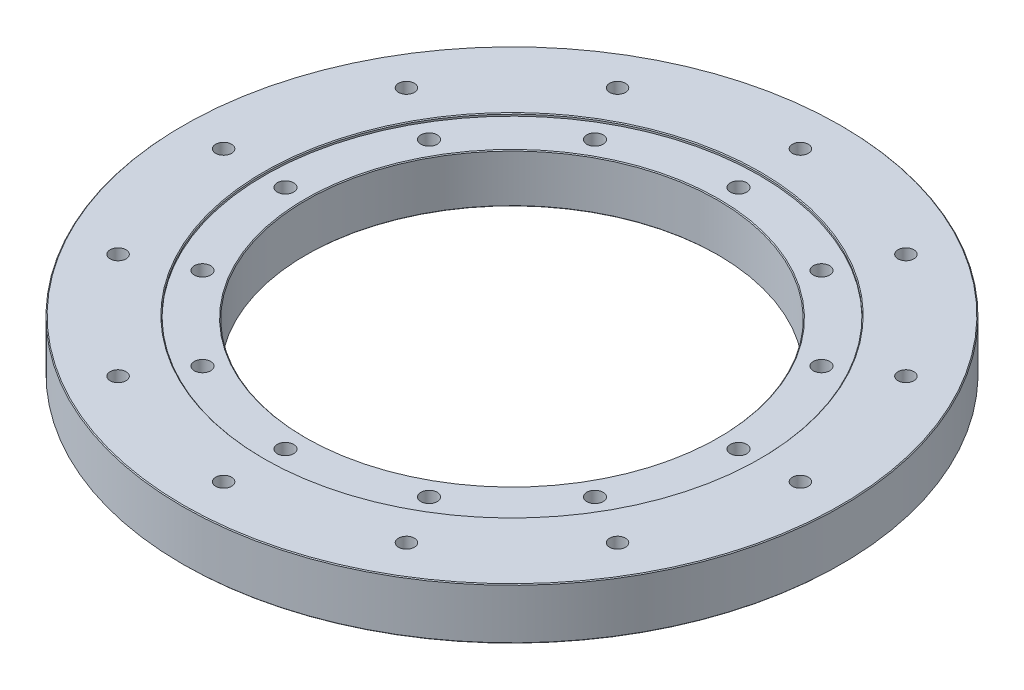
ISO-10303-21;
HEADER;
FILE_DESCRIPTION(('STEP AP214'),'2;1');
FILE_NAME('part.step','',(''),(''),'','','');
FILE_SCHEMA(('AUTOMOTIVE_DESIGN { 1 0 10303 214 1 1 1 1 }'));
ENDSEC;
DATA;
#1=APPLICATION_CONTEXT('core data for automotive mechanical design processes');
#2=APPLICATION_PROTOCOL_DEFINITION('international standard','automotive_design',2000,#1);
#3=PRODUCT_CONTEXT('',#1,'mechanical');
#4=PRODUCT('Part','Part','',(#3));
#5=PRODUCT_RELATED_PRODUCT_CATEGORY('part','',(#4));
#6=PRODUCT_DEFINITION_FORMATION('','',#4);
#7=PRODUCT_DEFINITION_CONTEXT('part definition',#1,'design');
#8=PRODUCT_DEFINITION('design','',#6,#7);
#9=PRODUCT_DEFINITION_SHAPE('','',#8);
#10=(LENGTH_UNIT() NAMED_UNIT(*) SI_UNIT(.MILLI.,.METRE.));
#11=(NAMED_UNIT(*) PLANE_ANGLE_UNIT() SI_UNIT($,.RADIAN.));
#12=(NAMED_UNIT(*) SI_UNIT($,.STERADIAN.) SOLID_ANGLE_UNIT());
#13=UNCERTAINTY_MEASURE_WITH_UNIT(LENGTH_MEASURE(1.E-05),#10,'distance_accuracy_value','');
#14=(GEOMETRIC_REPRESENTATION_CONTEXT(3) GLOBAL_UNCERTAINTY_ASSIGNED_CONTEXT((#13)) GLOBAL_UNIT_ASSIGNED_CONTEXT((#10,
#11,#12)) REPRESENTATION_CONTEXT('',''));
#15=CARTESIAN_POINT('',(0.,0.,0.));
#16=DIRECTION('',(0.,0.,1.));
#17=DIRECTION('',(1.,0.,0.));
#18=AXIS2_PLACEMENT_3D('',#15,#16,#17);
#19=CARTESIAN_POINT('',(0.,0.,0.));
#20=DIRECTION('',(0.,1.,0.));
#21=DIRECTION('',(0.,0.,1.));
#22=AXIS2_PLACEMENT_3D('',#19,#20,#21);
#23=PLANE('',#22);
#24=CARTESIAN_POINT('',(0.,0.,0.));
#25=DIRECTION('',(0.,1.,0.));
#26=DIRECTION('',(0.,0.,1.));
#27=AXIS2_PLACEMENT_3D('',#24,#25,#26);
#28=CIRCLE('',#27,127.508);
#29=CARTESIAN_POINT('',(0.,0.,127.508));
#30=VERTEX_POINT('',#29);
#31=EDGE_CURVE('E55',#30,#30,#28,.T.);
#32=ORIENTED_EDGE('',*,*,#31,.T.);
#33=EDGE_LOOP('',(#32));
#34=FACE_BOUND('',#33,.T.);
#35=CARTESIAN_POINT('',(0.,0.,0.));
#36=DIRECTION('',(0.,1.,0.));
#37=DIRECTION('',(0.,0.,1.));
#38=AXIS2_PLACEMENT_3D('',#35,#36,#37);
#39=CIRCLE('',#38,202.692);
#40=CARTESIAN_POINT('',(0.,0.,202.692));
#41=VERTEX_POINT('',#40);
#42=EDGE_CURVE('E70',#41,#41,#39,.F.);
#43=ORIENTED_EDGE('',*,*,#42,.T.);
#44=EDGE_LOOP('',(#43));
#45=FACE_BOUND('',#44,.T.);
#46=CARTESIAN_POINT('',(0.,0.,-177.8));
#47=DIRECTION('',(0.,1.,0.));
#48=DIRECTION('',(0.,0.,1.));
#49=AXIS2_PLACEMENT_3D('',#46,#47,#48);
#50=CIRCLE('',#49,4.90219999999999);
#51=CARTESIAN_POINT('',(0.,0.,-172.8978));
#52=VERTEX_POINT('',#51);
#53=EDGE_CURVE('E295',#52,#52,#50,.T.);
#54=ORIENTED_EDGE('',*,*,#53,.T.);
#55=EDGE_LOOP('',(#54));
#56=FACE_BOUND('',#55,.T.);
#57=CARTESIAN_POINT('',(88.9,0.,-153.979316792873));
#58=DIRECTION('',(0.,1.,0.));
#59=DIRECTION('',(0.,0.,1.));
#60=AXIS2_PLACEMENT_3D('',#57,#58,#59);
#61=CIRCLE('',#60,4.9022);
#62=CARTESIAN_POINT('',(88.9,0.,-149.077116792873));
#63=VERTEX_POINT('',#62);
#64=EDGE_CURVE('E289',#63,#63,#61,.T.);
#65=ORIENTED_EDGE('',*,*,#64,.T.);
#66=EDGE_LOOP('',(#65));
#67=FACE_BOUND('',#66,.T.);
#68=CARTESIAN_POINT('',(153.979316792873,0.,-88.9));
#69=DIRECTION('',(0.,1.,0.));
#70=DIRECTION('',(0.,0.,1.));
#71=AXIS2_PLACEMENT_3D('',#68,#69,#70);
#72=CIRCLE('',#71,4.9022);
#73=CARTESIAN_POINT('',(153.979316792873,0.,-83.9978));
#74=VERTEX_POINT('',#73);
#75=EDGE_CURVE('E283',#74,#74,#72,.T.);
#76=ORIENTED_EDGE('',*,*,#75,.T.);
#77=EDGE_LOOP('',(#76));
#78=FACE_BOUND('',#77,.T.);
#79=CARTESIAN_POINT('',(177.8,0.,0.));
#80=DIRECTION('',(0.,1.,0.));
#81=DIRECTION('',(0.,0.,1.));
#82=AXIS2_PLACEMENT_3D('',#79,#80,#81);
#83=CIRCLE('',#82,4.9022);
#84=CARTESIAN_POINT('',(177.8,0.,4.90219999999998));
#85=VERTEX_POINT('',#84);
#86=EDGE_CURVE('E277',#85,#85,#83,.T.);
#87=ORIENTED_EDGE('',*,*,#86,.T.);
#88=EDGE_LOOP('',(#87));
#89=FACE_BOUND('',#88,.T.);
#90=CARTESIAN_POINT('',(153.979316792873,0.,88.9));
#91=DIRECTION('',(0.,1.,0.));
#92=DIRECTION('',(0.,0.,1.));
#93=AXIS2_PLACEMENT_3D('',#90,#91,#92);
#94=CIRCLE('',#93,4.9022);
#95=CARTESIAN_POINT('',(153.979316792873,0.,93.8022));
#96=VERTEX_POINT('',#95);
#97=EDGE_CURVE('E271',#96,#96,#94,.T.);
#98=ORIENTED_EDGE('',*,*,#97,.T.);
#99=EDGE_LOOP('',(#98));
#100=FACE_BOUND('',#99,.T.);
#101=CARTESIAN_POINT('',(88.9,-1.11022302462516E-13,153.979316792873));
#102=DIRECTION('',(0.,1.,0.));
#103=DIRECTION('',(0.,0.,1.));
#104=AXIS2_PLACEMENT_3D('',#101,#102,#103);
#105=CIRCLE('',#104,4.9022);
#106=CARTESIAN_POINT('',(88.9,-1.12054943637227E-13,158.881516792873));
#107=VERTEX_POINT('',#106);
#108=EDGE_CURVE('E265',#107,#107,#105,.T.);
#109=ORIENTED_EDGE('',*,*,#108,.T.);
#110=EDGE_LOOP('',(#109));
#111=FACE_BOUND('',#110,.T.);
#112=CARTESIAN_POINT('',(0.,-1.11022302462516E-13,177.8));
#113=DIRECTION('',(0.,1.,0.));
#114=DIRECTION('',(0.,0.,1.));
#115=AXIS2_PLACEMENT_3D('',#112,#113,#114);
#116=CIRCLE('',#115,4.90219999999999);
#117=CARTESIAN_POINT('',(0.,-1.12054943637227E-13,182.7022));
#118=VERTEX_POINT('',#117);
#119=EDGE_CURVE('E259',#118,#118,#116,.T.);
#120=ORIENTED_EDGE('',*,*,#119,.T.);
#121=EDGE_LOOP('',(#120));
#122=FACE_BOUND('',#121,.T.);
#123=CARTESIAN_POINT('',(-88.8999999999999,-1.11022302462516E-13,153.979316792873));
#124=DIRECTION('',(0.,1.,0.));
#125=DIRECTION('',(0.,0.,1.));
#126=AXIS2_PLACEMENT_3D('',#123,#124,#125);
#127=CIRCLE('',#126,4.9022);
#128=CARTESIAN_POINT('',(-88.8999999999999,-1.12054943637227E-13,158.881516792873));
#129=VERTEX_POINT('',#128);
#130=EDGE_CURVE('E253',#129,#129,#127,.T.);
#131=ORIENTED_EDGE('',*,*,#130,.T.);
#132=EDGE_LOOP('',(#131));
#133=FACE_BOUND('',#132,.T.);
#134=CARTESIAN_POINT('',(-153.979316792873,0.,88.9000000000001));
#135=DIRECTION('',(0.,1.,0.));
#136=DIRECTION('',(0.,0.,1.));
#137=AXIS2_PLACEMENT_3D('',#134,#135,#136);
#138=CIRCLE('',#137,4.9022);
#139=CARTESIAN_POINT('',(-153.979316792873,0.,93.8022000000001));
#140=VERTEX_POINT('',#139);
#141=EDGE_CURVE('E247',#140,#140,#138,.T.);
#142=ORIENTED_EDGE('',*,*,#141,.T.);
#143=EDGE_LOOP('',(#142));
#144=FACE_BOUND('',#143,.T.);
#145=CARTESIAN_POINT('',(-177.8,0.,0.));
#146=DIRECTION('',(0.,1.,0.));
#147=DIRECTION('',(0.,0.,1.));
#148=AXIS2_PLACEMENT_3D('',#145,#146,#147);
#149=CIRCLE('',#148,4.9022);
#150=CARTESIAN_POINT('',(-177.8,0.,4.90220000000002));
#151=VERTEX_POINT('',#150);
#152=EDGE_CURVE('E241',#151,#151,#149,.T.);
#153=ORIENTED_EDGE('',*,*,#152,.T.);
#154=EDGE_LOOP('',(#153));
#155=FACE_BOUND('',#154,.T.);
#156=CARTESIAN_POINT('',(-153.979316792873,0.,-88.8999999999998));
#157=DIRECTION('',(0.,1.,0.));
#158=DIRECTION('',(0.,0.,1.));
#159=AXIS2_PLACEMENT_3D('',#156,#157,#158);
#160=CIRCLE('',#159,4.9022);
#161=CARTESIAN_POINT('',(-153.979316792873,0.,-83.9977999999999));
#162=VERTEX_POINT('',#161);
#163=EDGE_CURVE('E235',#162,#162,#160,.T.);
#164=ORIENTED_EDGE('',*,*,#163,.T.);
#165=EDGE_LOOP('',(#164));
#166=FACE_BOUND('',#165,.T.);
#167=CARTESIAN_POINT('',(-88.9,0.,-153.979316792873));
#168=DIRECTION('',(0.,1.,0.));
#169=DIRECTION('',(0.,0.,1.));
#170=AXIS2_PLACEMENT_3D('',#167,#168,#169);
#171=CIRCLE('',#170,4.9022);
#172=CARTESIAN_POINT('',(-88.9,0.,-149.077116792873));
#173=VERTEX_POINT('',#172);
#174=EDGE_CURVE('E229',#173,#173,#171,.T.);
#175=ORIENTED_EDGE('',*,*,#174,.T.);
#176=EDGE_LOOP('',(#175));
#177=FACE_BOUND('',#176,.T.);
#178=CARTESIAN_POINT('',(0.,0.,139.7));
#179=DIRECTION('',(0.,-1.,0.));
#180=DIRECTION('',(0.,0.,-1.));
#181=AXIS2_PLACEMENT_3D('',#178,#179,#180);
#182=CIRCLE('',#181,11.1125);
#183=CARTESIAN_POINT('',(0.,0.,128.5875));
#184=VERTEX_POINT('',#183);
#185=EDGE_CURVE('E226',#184,#184,#182,.T.);
#186=ORIENTED_EDGE('',*,*,#185,.F.);
#187=EDGE_LOOP('',(#186));
#188=FACE_BOUND('',#187,.T.);
#189=CARTESIAN_POINT('',(69.85,0.,120.983748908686));
#190=DIRECTION('',(0.,-1.,0.));
#191=DIRECTION('',(0.,0.,-1.));
#192=AXIS2_PLACEMENT_3D('',#189,#190,#191);
#193=CIRCLE('',#192,11.1125);
#194=CARTESIAN_POINT('',(69.85,0.,109.871248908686));
#195=VERTEX_POINT('',#194);
#196=EDGE_CURVE('E214',#195,#195,#193,.T.);
#197=ORIENTED_EDGE('',*,*,#196,.F.);
#198=EDGE_LOOP('',(#197));
#199=FACE_BOUND('',#198,.T.);
#200=CARTESIAN_POINT('',(120.983748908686,0.,69.85));
#201=DIRECTION('',(0.,-1.,0.));
#202=DIRECTION('',(0.,0.,-1.));
#203=AXIS2_PLACEMENT_3D('',#200,#201,#202);
#204=CIRCLE('',#203,11.1125);
#205=CARTESIAN_POINT('',(120.983748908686,0.,58.7375));
#206=VERTEX_POINT('',#205);
#207=EDGE_CURVE('E202',#206,#206,#204,.T.);
#208=ORIENTED_EDGE('',*,*,#207,.F.);
#209=EDGE_LOOP('',(#208));
#210=FACE_BOUND('',#209,.T.);
#211=CARTESIAN_POINT('',(139.7,0.,0.));
#212=DIRECTION('',(0.,-1.,0.));
#213=DIRECTION('',(0.,0.,-1.));
#214=AXIS2_PLACEMENT_3D('',#211,#212,#213);
#215=CIRCLE('',#214,11.1125);
#216=CARTESIAN_POINT('',(139.7,0.,-11.1125));
#217=VERTEX_POINT('',#216);
#218=EDGE_CURVE('E190',#217,#217,#215,.T.);
#219=ORIENTED_EDGE('',*,*,#218,.F.);
#220=EDGE_LOOP('',(#219));
#221=FACE_BOUND('',#220,.T.);
#222=CARTESIAN_POINT('',(120.983748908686,0.,-69.85));
#223=DIRECTION('',(0.,-1.,0.));
#224=DIRECTION('',(0.,0.,-1.));
#225=AXIS2_PLACEMENT_3D('',#222,#223,#224);
#226=CIRCLE('',#225,11.1125);
#227=CARTESIAN_POINT('',(120.983748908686,0.,-80.9625));
#228=VERTEX_POINT('',#227);
#229=EDGE_CURVE('E178',#228,#228,#226,.T.);
#230=ORIENTED_EDGE('',*,*,#229,.F.);
#231=EDGE_LOOP('',(#230));
#232=FACE_BOUND('',#231,.T.);
#233=CARTESIAN_POINT('',(69.8500000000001,0.,-120.983748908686));
#234=DIRECTION('',(0.,-1.,0.));
#235=DIRECTION('',(0.,0.,-1.));
#236=AXIS2_PLACEMENT_3D('',#233,#234,#235);
#237=CIRCLE('',#236,11.1125);
#238=CARTESIAN_POINT('',(69.8500000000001,0.,-132.096248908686));
#239=VERTEX_POINT('',#238);
#240=EDGE_CURVE('E166',#239,#239,#237,.T.);
#241=ORIENTED_EDGE('',*,*,#240,.F.);
#242=EDGE_LOOP('',(#241));
#243=FACE_BOUND('',#242,.T.);
#244=CARTESIAN_POINT('',(0.,0.,-139.7));
#245=DIRECTION('',(0.,-1.,0.));
#246=DIRECTION('',(0.,0.,-1.));
#247=AXIS2_PLACEMENT_3D('',#244,#245,#246);
#248=CIRCLE('',#247,11.1125);
#249=CARTESIAN_POINT('',(0.,0.,-150.8125));
#250=VERTEX_POINT('',#249);
#251=EDGE_CURVE('E154',#250,#250,#248,.T.);
#252=ORIENTED_EDGE('',*,*,#251,.F.);
#253=EDGE_LOOP('',(#252));
#254=FACE_BOUND('',#253,.T.);
#255=CARTESIAN_POINT('',(-69.85,0.,-120.983748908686));
#256=DIRECTION('',(0.,-1.,0.));
#257=DIRECTION('',(0.,0.,-1.));
#258=AXIS2_PLACEMENT_3D('',#255,#256,#257);
#259=CIRCLE('',#258,11.1125);
#260=CARTESIAN_POINT('',(-69.85,0.,-132.096248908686));
#261=VERTEX_POINT('',#260);
#262=EDGE_CURVE('E142',#261,#261,#259,.T.);
#263=ORIENTED_EDGE('',*,*,#262,.F.);
#264=EDGE_LOOP('',(#263));
#265=FACE_BOUND('',#264,.T.);
#266=CARTESIAN_POINT('',(-120.983748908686,0.,-69.8500000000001));
#267=DIRECTION('',(0.,-1.,0.));
#268=DIRECTION('',(0.,0.,-1.));
#269=AXIS2_PLACEMENT_3D('',#266,#267,#268);
#270=CIRCLE('',#269,11.1125);
#271=CARTESIAN_POINT('',(-120.983748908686,0.,-80.9625000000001));
#272=VERTEX_POINT('',#271);
#273=EDGE_CURVE('E130',#272,#272,#270,.T.);
#274=ORIENTED_EDGE('',*,*,#273,.F.);
#275=EDGE_LOOP('',(#274));
#276=FACE_BOUND('',#275,.T.);
#277=CARTESIAN_POINT('',(-120.983748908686,0.,69.8499999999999));
#278=DIRECTION('',(0.,-1.,0.));
#279=DIRECTION('',(0.,0.,-1.));
#280=AXIS2_PLACEMENT_3D('',#277,#278,#279);
#281=CIRCLE('',#280,11.1125);
#282=CARTESIAN_POINT('',(-120.983748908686,0.,58.7374999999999));
#283=VERTEX_POINT('',#282);
#284=EDGE_CURVE('E106',#283,#283,#281,.T.);
#285=ORIENTED_EDGE('',*,*,#284,.F.);
#286=EDGE_LOOP('',(#285));
#287=FACE_BOUND('',#286,.T.);
#288=CARTESIAN_POINT('',(-69.85,0.,120.983748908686));
#289=DIRECTION('',(0.,-1.,0.));
#290=DIRECTION('',(0.,0.,-1.));
#291=AXIS2_PLACEMENT_3D('',#288,#289,#290);
#292=CIRCLE('',#291,11.1125);
#293=CARTESIAN_POINT('',(-69.85,0.,109.871248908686));
#294=VERTEX_POINT('',#293);
#295=EDGE_CURVE('E94',#294,#294,#292,.T.);
#296=ORIENTED_EDGE('',*,*,#295,.F.);
#297=EDGE_LOOP('',(#296));
#298=FACE_BOUND('',#297,.T.);
#299=CARTESIAN_POINT('',(-139.7,0.,0.));
#300=DIRECTION('',(0.,-1.,0.));
#301=DIRECTION('',(0.,0.,-1.));
#302=AXIS2_PLACEMENT_3D('',#299,#300,#301);
#303=CIRCLE('',#302,11.1125);
#304=CARTESIAN_POINT('',(-139.7,0.,-11.1125));
#305=VERTEX_POINT('',#304);
#306=EDGE_CURVE('E118',#305,#305,#303,.T.);
#307=ORIENTED_EDGE('',*,*,#306,.F.);
#308=EDGE_LOOP('',(#307));
#309=FACE_BOUND('',#308,.T.);
#310=ADVANCED_FACE('F44',(#34,#45,#56,#67,#78,#89,#100,#111,#122,#133,#144,#155,#166,#177,#188,
#199,#210,#221,#232,#243,#254,#265,#276,#287,#298,#309),#23,.F.);
#311=CARTESIAN_POINT('',(0.,30.1625,5.14996031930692E-13));
#312=DIRECTION('',(0.,1.,0.));
#313=DIRECTION('',(0.,0.,1.));
#314=AXIS2_PLACEMENT_3D('',#311,#312,#313);
#315=PLANE('',#314);
#316=CARTESIAN_POINT('',(0.,30.1625,0.));
#317=DIRECTION('',(0.,1.,0.));
#318=DIRECTION('',(0.,0.,1.));
#319=AXIS2_PLACEMENT_3D('',#316,#317,#318);
#320=CIRCLE('',#319,127.508);
#321=CARTESIAN_POINT('',(0.,30.1625,127.508));
#322=VERTEX_POINT('',#321);
#323=EDGE_CURVE('E67',#322,#322,#320,.F.);
#324=ORIENTED_EDGE('',*,*,#323,.T.);
#325=EDGE_LOOP('',(#324));
#326=FACE_BOUND('',#325,.T.);
#327=CARTESIAN_POINT('',(0.,30.1625,139.7));
#328=DIRECTION('',(0.,1.,0.));
#329=DIRECTION('',(0.,0.,1.));
#330=AXIS2_PLACEMENT_3D('',#327,#328,#329);
#331=CIRCLE('',#330,5.04189999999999);
#332=CARTESIAN_POINT('',(0.,30.1625,144.7419));
#333=VERTEX_POINT('',#332);
#334=EDGE_CURVE('E217',#333,#333,#331,.T.);
#335=ORIENTED_EDGE('',*,*,#334,.F.);
#336=EDGE_LOOP('',(#335));
#337=FACE_BOUND('',#336,.T.);
#338=CARTESIAN_POINT('',(69.85,30.1625,120.983748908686));
#339=DIRECTION('',(0.,1.,0.));
#340=DIRECTION('',(0.,0.,1.));
#341=AXIS2_PLACEMENT_3D('',#338,#339,#340);
#342=CIRCLE('',#341,5.04189999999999);
#343=CARTESIAN_POINT('',(69.85,30.1625,126.025648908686));
#344=VERTEX_POINT('',#343);
#345=EDGE_CURVE('E205',#344,#344,#342,.T.);
#346=ORIENTED_EDGE('',*,*,#345,.F.);
#347=EDGE_LOOP('',(#346));
#348=FACE_BOUND('',#347,.T.);
#349=CARTESIAN_POINT('',(120.983748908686,30.1625,69.85));
#350=DIRECTION('',(0.,1.,0.));
#351=DIRECTION('',(0.,0.,1.));
#352=AXIS2_PLACEMENT_3D('',#349,#350,#351);
#353=CIRCLE('',#352,5.04189999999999);
#354=CARTESIAN_POINT('',(120.983748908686,30.1625,74.8919));
#355=VERTEX_POINT('',#354);
#356=EDGE_CURVE('E193',#355,#355,#353,.T.);
#357=ORIENTED_EDGE('',*,*,#356,.F.);
#358=EDGE_LOOP('',(#357));
#359=FACE_BOUND('',#358,.T.);
#360=CARTESIAN_POINT('',(139.7,30.1625,0.));
#361=DIRECTION('',(0.,1.,0.));
#362=DIRECTION('',(0.,0.,1.));
#363=AXIS2_PLACEMENT_3D('',#360,#361,#362);
#364=CIRCLE('',#363,5.04189999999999);
#365=CARTESIAN_POINT('',(139.7,30.1625,5.0419));
#366=VERTEX_POINT('',#365);
#367=EDGE_CURVE('E181',#366,#366,#364,.T.);
#368=ORIENTED_EDGE('',*,*,#367,.F.);
#369=EDGE_LOOP('',(#368));
#370=FACE_BOUND('',#369,.T.);
#371=CARTESIAN_POINT('',(120.983748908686,30.1625,-69.85));
#372=DIRECTION('',(0.,1.,0.));
#373=DIRECTION('',(0.,0.,1.));
#374=AXIS2_PLACEMENT_3D('',#371,#372,#373);
#375=CIRCLE('',#374,5.04189999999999);
#376=CARTESIAN_POINT('',(120.983748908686,30.1625,-64.8081));
#377=VERTEX_POINT('',#376);
#378=EDGE_CURVE('E169',#377,#377,#375,.T.);
#379=ORIENTED_EDGE('',*,*,#378,.F.);
#380=EDGE_LOOP('',(#379));
#381=FACE_BOUND('',#380,.T.);
#382=CARTESIAN_POINT('',(69.8500000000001,30.1625,-120.983748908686));
#383=DIRECTION('',(0.,1.,0.));
#384=DIRECTION('',(0.,0.,1.));
#385=AXIS2_PLACEMENT_3D('',#382,#383,#384);
#386=CIRCLE('',#385,5.04189999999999);
#387=CARTESIAN_POINT('',(69.8500000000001,30.1625,-115.941848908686));
#388=VERTEX_POINT('',#387);
#389=EDGE_CURVE('E157',#388,#388,#386,.T.);
#390=ORIENTED_EDGE('',*,*,#389,.F.);
#391=EDGE_LOOP('',(#390));
#392=FACE_BOUND('',#391,.T.);
#393=CARTESIAN_POINT('',(0.,30.1625,-139.7));
#394=DIRECTION('',(0.,1.,0.));
#395=DIRECTION('',(0.,0.,1.));
#396=AXIS2_PLACEMENT_3D('',#393,#394,#395);
#397=CIRCLE('',#396,5.04189999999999);
#398=CARTESIAN_POINT('',(0.,30.1625,-134.6581));
#399=VERTEX_POINT('',#398);
#400=EDGE_CURVE('E145',#399,#399,#397,.T.);
#401=ORIENTED_EDGE('',*,*,#400,.F.);
#402=EDGE_LOOP('',(#401));
#403=FACE_BOUND('',#402,.T.);
#404=CARTESIAN_POINT('',(-69.85,30.1625,-120.983748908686));
#405=DIRECTION('',(0.,1.,0.));
#406=DIRECTION('',(0.,0.,1.));
#407=AXIS2_PLACEMENT_3D('',#404,#405,#406);
#408=CIRCLE('',#407,5.04189999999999);
#409=CARTESIAN_POINT('',(-69.85,30.1625,-115.941848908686));
#410=VERTEX_POINT('',#409);
#411=EDGE_CURVE('E133',#410,#410,#408,.T.);
#412=ORIENTED_EDGE('',*,*,#411,.F.);
#413=EDGE_LOOP('',(#412));
#414=FACE_BOUND('',#413,.T.);
#415=CARTESIAN_POINT('',(-120.983748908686,30.1625,-69.8500000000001));
#416=DIRECTION('',(0.,1.,0.));
#417=DIRECTION('',(0.,0.,1.));
#418=AXIS2_PLACEMENT_3D('',#415,#416,#417);
#419=CIRCLE('',#418,5.04189999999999);
#420=CARTESIAN_POINT('',(-120.983748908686,30.1625,-64.8081000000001));
#421=VERTEX_POINT('',#420);
#422=EDGE_CURVE('E121',#421,#421,#419,.T.);
#423=ORIENTED_EDGE('',*,*,#422,.F.);
#424=EDGE_LOOP('',(#423));
#425=FACE_BOUND('',#424,.T.);
#426=CARTESIAN_POINT('',(-139.7,30.1625,0.));
#427=DIRECTION('',(0.,1.,0.));
#428=DIRECTION('',(0.,0.,1.));
#429=AXIS2_PLACEMENT_3D('',#426,#427,#428);
#430=CIRCLE('',#429,5.04189999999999);
#431=CARTESIAN_POINT('',(-139.7,30.1625,5.04189999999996));
#432=VERTEX_POINT('',#431);
#433=EDGE_CURVE('E109',#432,#432,#430,.T.);
#434=ORIENTED_EDGE('',*,*,#433,.F.);
#435=EDGE_LOOP('',(#434));
#436=FACE_BOUND('',#435,.T.);
#437=CARTESIAN_POINT('',(-120.983748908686,30.1625,69.8499999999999));
#438=DIRECTION('',(0.,1.,0.));
#439=DIRECTION('',(0.,0.,1.));
#440=AXIS2_PLACEMENT_3D('',#437,#438,#439);
#441=CIRCLE('',#440,5.04189999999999);
#442=CARTESIAN_POINT('',(-120.983748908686,30.1625,74.8918999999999));
#443=VERTEX_POINT('',#442);
#444=EDGE_CURVE('E97',#443,#443,#441,.T.);
#445=ORIENTED_EDGE('',*,*,#444,.F.);
#446=EDGE_LOOP('',(#445));
#447=FACE_BOUND('',#446,.T.);
#448=CARTESIAN_POINT('',(-69.85,30.1625,120.983748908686));
#449=DIRECTION('',(0.,1.,0.));
#450=DIRECTION('',(0.,0.,1.));
#451=AXIS2_PLACEMENT_3D('',#448,#449,#450);
#452=CIRCLE('',#451,5.04189999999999);
#453=CARTESIAN_POINT('',(-69.85,30.1625,126.025648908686));
#454=VERTEX_POINT('',#453);
#455=EDGE_CURVE('E85',#454,#454,#452,.T.);
#456=ORIENTED_EDGE('',*,*,#455,.F.);
#457=EDGE_LOOP('',(#456));
#458=FACE_BOUND('',#457,.T.);
#459=CARTESIAN_POINT('',(0.,30.1625,0.));
#460=DIRECTION('',(0.,-1.,0.));
#461=DIRECTION('',(0.,0.,-1.));
#462=AXIS2_PLACEMENT_3D('',#459,#460,#461);
#463=CIRCLE('',#462,152.6032);
#464=CARTESIAN_POINT('',(0.,30.1625,-152.6032));
#465=VERTEX_POINT('',#464);
#466=EDGE_CURVE('E82',#465,#465,#463,.T.);
#467=ORIENTED_EDGE('',*,*,#466,.F.);
#468=EDGE_LOOP('',(#467));
#469=FACE_BOUND('',#468,.T.);
#470=ADVANCED_FACE('F350',(#326,#337,#348,#359,#370,#381,#392,#403,#414,#425,#436,#447,#458,
#469),#315,.T.);
#471=CARTESIAN_POINT('',(0.,0.,0.));
#472=DIRECTION('',(0.,-1.,0.));
#473=DIRECTION('',(0.,0.,-1.));
#474=AXIS2_PLACEMENT_3D('',#471,#472,#473);
#475=CYLINDRICAL_SURFACE('',#474,152.6032);
#476=CARTESIAN_POINT('',(0.,31.2419999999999,0.));
#477=DIRECTION('',(0.,1.,0.));
#478=DIRECTION('',(0.,0.,1.));
#479=AXIS2_PLACEMENT_3D('',#476,#477,#478);
#480=CIRCLE('',#479,152.6032);
#481=CARTESIAN_POINT('',(0.,31.2419999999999,152.6032));
#482=VERTEX_POINT('',#481);
#483=EDGE_CURVE('E12',#482,#482,#480,.T.);
#484=ORIENTED_EDGE('',*,*,#483,.T.);
#485=EDGE_LOOP('',(#484));
#486=FACE_BOUND('',#485,.T.);
#487=ORIENTED_EDGE('',*,*,#466,.T.);
#488=EDGE_LOOP('',(#487));
#489=FACE_BOUND('',#488,.T.);
#490=ADVANCED_FACE('F308',(#486,#489),#475,.F.);
#491=CARTESIAN_POINT('',(0.,31.75,0.));
#492=DIRECTION('',(0.,1.,0.));
#493=DIRECTION('',(0.,0.,1.));
#494=AXIS2_PLACEMENT_3D('',#491,#492,#493);
#495=PLANE('',#494);
#496=CARTESIAN_POINT('',(0.,31.75,0.));
#497=DIRECTION('',(0.,1.,0.));
#498=DIRECTION('',(0.,0.,1.));
#499=AXIS2_PLACEMENT_3D('',#496,#497,#498);
#500=CIRCLE('',#499,153.1112);
#501=CARTESIAN_POINT('',(0.,31.75,153.1112));
#502=VERTEX_POINT('',#501);
#503=EDGE_CURVE('E51',#502,#502,#500,.F.);
#504=ORIENTED_EDGE('',*,*,#503,.T.);
#505=EDGE_LOOP('',(#504));
#506=FACE_BOUND('',#505,.T.);
#507=CARTESIAN_POINT('',(0.,31.75,0.));
#508=DIRECTION('',(0.,1.,0.));
#509=DIRECTION('',(0.,0.,1.));
#510=AXIS2_PLACEMENT_3D('',#507,#508,#509);
#511=CIRCLE('',#510,202.692);
#512=CARTESIAN_POINT('',(0.,31.75,202.692));
#513=VERTEX_POINT('',#512);
#514=EDGE_CURVE('E73',#513,#513,#511,.T.);
#515=ORIENTED_EDGE('',*,*,#514,.T.);
#516=EDGE_LOOP('',(#515));
#517=FACE_BOUND('',#516,.T.);
#518=CARTESIAN_POINT('',(0.,31.75,-177.8));
#519=DIRECTION('',(0.,1.,0.));
#520=DIRECTION('',(0.,0.,1.));
#521=AXIS2_PLACEMENT_3D('',#518,#519,#520);
#522=CIRCLE('',#521,4.90219999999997);
#523=CARTESIAN_POINT('',(0.,31.75,-172.8978));
#524=VERTEX_POINT('',#523);
#525=EDGE_CURVE('E298',#524,#524,#522,.T.);
#526=ORIENTED_EDGE('',*,*,#525,.F.);
#527=EDGE_LOOP('',(#526));
#528=FACE_BOUND('',#527,.T.);
#529=CARTESIAN_POINT('',(88.9,31.75,-153.979316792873));
#530=DIRECTION('',(0.,1.,0.));
#531=DIRECTION('',(0.,0.,1.));
#532=AXIS2_PLACEMENT_3D('',#529,#530,#531);
#533=CIRCLE('',#532,4.90219999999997);
#534=CARTESIAN_POINT('',(88.9,31.75,-149.077116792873));
#535=VERTEX_POINT('',#534);
#536=EDGE_CURVE('E292',#535,#535,#533,.T.);
#537=ORIENTED_EDGE('',*,*,#536,.F.);
#538=EDGE_LOOP('',(#537));
#539=FACE_BOUND('',#538,.T.);
#540=CARTESIAN_POINT('',(153.979316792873,31.75,-88.9));
#541=DIRECTION('',(0.,1.,0.));
#542=DIRECTION('',(0.,0.,1.));
#543=AXIS2_PLACEMENT_3D('',#540,#541,#542);
#544=CIRCLE('',#543,4.90219999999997);
#545=CARTESIAN_POINT('',(153.979316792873,31.75,-83.9978));
#546=VERTEX_POINT('',#545);
#547=EDGE_CURVE('E286',#546,#546,#544,.T.);
#548=ORIENTED_EDGE('',*,*,#547,.F.);
#549=EDGE_LOOP('',(#548));
#550=FACE_BOUND('',#549,.T.);
#551=CARTESIAN_POINT('',(177.8,31.75,0.));
#552=DIRECTION('',(0.,1.,0.));
#553=DIRECTION('',(0.,0.,1.));
#554=AXIS2_PLACEMENT_3D('',#551,#552,#553);
#555=CIRCLE('',#554,4.90219999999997);
#556=CARTESIAN_POINT('',(177.8,31.75,4.90219999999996));
#557=VERTEX_POINT('',#556);
#558=EDGE_CURVE('E280',#557,#557,#555,.T.);
#559=ORIENTED_EDGE('',*,*,#558,.F.);
#560=EDGE_LOOP('',(#559));
#561=FACE_BOUND('',#560,.T.);
#562=CARTESIAN_POINT('',(153.979316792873,31.75,88.9));
#563=DIRECTION('',(0.,1.,0.));
#564=DIRECTION('',(0.,0.,1.));
#565=AXIS2_PLACEMENT_3D('',#562,#563,#564);
#566=CIRCLE('',#565,4.90219999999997);
#567=CARTESIAN_POINT('',(153.979316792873,31.75,93.8021999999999));
#568=VERTEX_POINT('',#567);
#569=EDGE_CURVE('E274',#568,#568,#566,.T.);
#570=ORIENTED_EDGE('',*,*,#569,.F.);
#571=EDGE_LOOP('',(#570));
#572=FACE_BOUND('',#571,.T.);
#573=CARTESIAN_POINT('',(88.9,31.7499999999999,153.979316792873));
#574=DIRECTION('',(0.,1.,0.));
#575=DIRECTION('',(0.,0.,1.));
#576=AXIS2_PLACEMENT_3D('',#573,#574,#575);
#577=CIRCLE('',#576,4.90219999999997);
#578=CARTESIAN_POINT('',(88.9,31.7499999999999,158.881516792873));
#579=VERTEX_POINT('',#578);
#580=EDGE_CURVE('E268',#579,#579,#577,.T.);
#581=ORIENTED_EDGE('',*,*,#580,.F.);
#582=EDGE_LOOP('',(#581));
#583=FACE_BOUND('',#582,.T.);
#584=CARTESIAN_POINT('',(0.,31.7499999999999,177.8));
#585=DIRECTION('',(0.,1.,0.));
#586=DIRECTION('',(0.,0.,1.));
#587=AXIS2_PLACEMENT_3D('',#584,#585,#586);
#588=CIRCLE('',#587,4.90219999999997);
#589=CARTESIAN_POINT('',(0.,31.7499999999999,182.7022));
#590=VERTEX_POINT('',#589);
#591=EDGE_CURVE('E262',#590,#590,#588,.T.);
#592=ORIENTED_EDGE('',*,*,#591,.F.);
#593=EDGE_LOOP('',(#592));
#594=FACE_BOUND('',#593,.T.);
#595=CARTESIAN_POINT('',(-88.8999999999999,31.7499999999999,153.979316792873));
#596=DIRECTION('',(0.,1.,0.));
#597=DIRECTION('',(0.,0.,1.));
#598=AXIS2_PLACEMENT_3D('',#595,#596,#597);
#599=CIRCLE('',#598,4.90219999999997);
#600=CARTESIAN_POINT('',(-88.8999999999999,31.7499999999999,158.881516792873));
#601=VERTEX_POINT('',#600);
#602=EDGE_CURVE('E256',#601,#601,#599,.T.);
#603=ORIENTED_EDGE('',*,*,#602,.F.);
#604=EDGE_LOOP('',(#603));
#605=FACE_BOUND('',#604,.T.);
#606=CARTESIAN_POINT('',(-153.979316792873,31.75,88.9000000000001));
#607=DIRECTION('',(0.,1.,0.));
#608=DIRECTION('',(0.,0.,1.));
#609=AXIS2_PLACEMENT_3D('',#606,#607,#608);
#610=CIRCLE('',#609,4.90219999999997);
#611=CARTESIAN_POINT('',(-153.979316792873,31.75,93.8022));
#612=VERTEX_POINT('',#611);
#613=EDGE_CURVE('E250',#612,#612,#610,.T.);
#614=ORIENTED_EDGE('',*,*,#613,.F.);
#615=EDGE_LOOP('',(#614));
#616=FACE_BOUND('',#615,.T.);
#617=CARTESIAN_POINT('',(-177.8,31.75,0.));
#618=DIRECTION('',(0.,1.,0.));
#619=DIRECTION('',(0.,0.,1.));
#620=AXIS2_PLACEMENT_3D('',#617,#618,#619);
#621=CIRCLE('',#620,4.90219999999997);
#622=CARTESIAN_POINT('',(-177.8,31.75,4.9022));
#623=VERTEX_POINT('',#622);
#624=EDGE_CURVE('E244',#623,#623,#621,.T.);
#625=ORIENTED_EDGE('',*,*,#624,.F.);
#626=EDGE_LOOP('',(#625));
#627=FACE_BOUND('',#626,.T.);
#628=CARTESIAN_POINT('',(-153.979316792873,31.75,-88.8999999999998));
#629=DIRECTION('',(0.,1.,0.));
#630=DIRECTION('',(0.,0.,1.));
#631=AXIS2_PLACEMENT_3D('',#628,#629,#630);
#632=CIRCLE('',#631,4.90219999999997);
#633=CARTESIAN_POINT('',(-153.979316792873,31.75,-83.9977999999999));
#634=VERTEX_POINT('',#633);
#635=EDGE_CURVE('E238',#634,#634,#632,.T.);
#636=ORIENTED_EDGE('',*,*,#635,.F.);
#637=EDGE_LOOP('',(#636));
#638=FACE_BOUND('',#637,.T.);
#639=CARTESIAN_POINT('',(-88.9,31.75,-153.979316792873));
#640=DIRECTION('',(0.,1.,0.));
#641=DIRECTION('',(0.,0.,1.));
#642=AXIS2_PLACEMENT_3D('',#639,#640,#641);
#643=CIRCLE('',#642,4.90219999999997);
#644=CARTESIAN_POINT('',(-88.9,31.75,-149.077116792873));
#645=VERTEX_POINT('',#644);
#646=EDGE_CURVE('E232',#645,#645,#643,.T.);
#647=ORIENTED_EDGE('',*,*,#646,.F.);
#648=EDGE_LOOP('',(#647));
#649=FACE_BOUND('',#648,.T.);
#650=ADVANCED_FACE('F304',(#506,#517,#528,#539,#550,#561,#572,#583,#594,#605,#616,#627,#638,
#649),#495,.T.);
#651=CARTESIAN_POINT('',(0.,0.,0.));
#652=DIRECTION('',(0.,-1.,0.));
#653=DIRECTION('',(0.,0.,-1.));
#654=AXIS2_PLACEMENT_3D('',#651,#652,#653);
#655=CYLINDRICAL_SURFACE('',#654,203.2);
#656=CARTESIAN_POINT('',(0.,31.242,0.));
#657=DIRECTION('',(0.,1.,0.));
#658=DIRECTION('',(0.,0.,1.));
#659=AXIS2_PLACEMENT_3D('',#656,#657,#658);
#660=CIRCLE('',#659,203.2);
#661=CARTESIAN_POINT('',(0.,31.242,203.2));
#662=VERTEX_POINT('',#661);
#663=EDGE_CURVE('E76',#662,#662,#660,.F.);
#664=ORIENTED_EDGE('',*,*,#663,.T.);
#665=EDGE_LOOP('',(#664));
#666=FACE_BOUND('',#665,.T.);
#667=CARTESIAN_POINT('',(0.,0.507999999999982,0.));
#668=DIRECTION('',(0.,1.,0.));
#669=DIRECTION('',(0.,0.,1.));
#670=AXIS2_PLACEMENT_3D('',#667,#668,#669);
#671=CIRCLE('',#670,203.2);
#672=CARTESIAN_POINT('',(0.,0.507999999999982,203.2));
#673=VERTEX_POINT('',#672);
#674=EDGE_CURVE('E79',#673,#673,#671,.T.);
#675=ORIENTED_EDGE('',*,*,#674,.T.);
#676=EDGE_LOOP('',(#675));
#677=FACE_BOUND('',#676,.T.);
#678=ADVANCED_FACE('F307',(#666,#677),#655,.T.);
#679=CARTESIAN_POINT('',(0.,0.,0.));
#680=DIRECTION('',(0.,-1.,0.));
#681=DIRECTION('',(0.,0.,-1.));
#682=AXIS2_PLACEMENT_3D('',#679,#680,#681);
#683=CYLINDRICAL_SURFACE('',#682,127.);
#684=CARTESIAN_POINT('',(0.,29.6545,0.));
#685=DIRECTION('',(0.,1.,0.));
#686=DIRECTION('',(0.,0.,1.));
#687=AXIS2_PLACEMENT_3D('',#684,#685,#686);
#688=CIRCLE('',#687,127.);
#689=CARTESIAN_POINT('',(0.,29.6545,127.));
#690=VERTEX_POINT('',#689);
#691=EDGE_CURVE('E59',#690,#690,#688,.T.);
#692=ORIENTED_EDGE('',*,*,#691,.T.);
#693=EDGE_LOOP('',(#692));
#694=FACE_BOUND('',#693,.T.);
#695=CARTESIAN_POINT('',(0.,0.507999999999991,0.));
#696=DIRECTION('',(0.,1.,0.));
#697=DIRECTION('',(0.,0.,1.));
#698=AXIS2_PLACEMENT_3D('',#695,#696,#697);
#699=CIRCLE('',#698,127.);
#700=CARTESIAN_POINT('',(0.,0.507999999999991,127.));
#701=VERTEX_POINT('',#700);
#702=EDGE_CURVE('E64',#701,#701,#699,.F.);
#703=ORIENTED_EDGE('',*,*,#702,.T.);
#704=EDGE_LOOP('',(#703));
#705=FACE_BOUND('',#704,.T.);
#706=ADVANCED_FACE('F361',(#694,#705),#683,.F.);
#707=CARTESIAN_POINT('',(-69.85,0.,120.983748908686));
#708=DIRECTION('',(0.,-1.,0.));
#709=DIRECTION('',(0.,0.,-1.));
#710=AXIS2_PLACEMENT_3D('',#707,#708,#709);
#711=CYLINDRICAL_SURFACE('',#710,5.04189999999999);
#712=CARTESIAN_POINT('',(-69.85,13.8684,120.983748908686));
#713=DIRECTION('',(0.,-1.,0.));
#714=DIRECTION('',(0.,0.,-1.));
#715=AXIS2_PLACEMENT_3D('',#712,#713,#714);
#716=CIRCLE('',#715,5.0419);
#717=CARTESIAN_POINT('',(-69.85,13.8684,115.941848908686));
#718=VERTEX_POINT('',#717);
#719=EDGE_CURVE('E88',#718,#718,#716,.T.);
#720=ORIENTED_EDGE('',*,*,#719,.T.);
#721=EDGE_LOOP('',(#720));
#722=FACE_BOUND('',#721,.T.);
#723=ORIENTED_EDGE('',*,*,#455,.T.);
#724=EDGE_LOOP('',(#723));
#725=FACE_BOUND('',#724,.T.);
#726=ADVANCED_FACE('F391',(#722,#725),#711,.F.);
#727=CARTESIAN_POINT('',(-64.8081,13.8684,120.983748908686));
#728=DIRECTION('',(0.,1.,0.));
#729=DIRECTION('',(0.,0.,1.));
#730=AXIS2_PLACEMENT_3D('',#727,#728,#729);
#731=PLANE('',#730);
#732=ORIENTED_EDGE('',*,*,#719,.F.);
#733=EDGE_LOOP('',(#732));
#734=FACE_BOUND('',#733,.T.);
#735=CARTESIAN_POINT('',(-69.85,13.8684,120.983748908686));
#736=DIRECTION('',(0.,-1.,0.));
#737=DIRECTION('',(0.,0.,-1.));
#738=AXIS2_PLACEMENT_3D('',#735,#736,#737);
#739=CIRCLE('',#738,11.1125);
#740=CARTESIAN_POINT('',(-69.85,13.8684,109.871248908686));
#741=VERTEX_POINT('',#740);
#742=EDGE_CURVE('E91',#741,#741,#739,.T.);
#743=ORIENTED_EDGE('',*,*,#742,.T.);
#744=EDGE_LOOP('',(#743));
#745=FACE_BOUND('',#744,.T.);
#746=ADVANCED_FACE('F396',(#734,#745),#731,.F.);
#747=CARTESIAN_POINT('',(-69.85,0.,120.983748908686));
#748=DIRECTION('',(0.,-1.,0.));
#749=DIRECTION('',(0.,0.,-1.));
#750=AXIS2_PLACEMENT_3D('',#747,#748,#749);
#751=CYLINDRICAL_SURFACE('',#750,11.1125);
#752=ORIENTED_EDGE('',*,*,#742,.F.);
#753=EDGE_LOOP('',(#752));
#754=FACE_BOUND('',#753,.T.);
#755=ORIENTED_EDGE('',*,*,#295,.T.);
#756=EDGE_LOOP('',(#755));
#757=FACE_BOUND('',#756,.T.);
#758=ADVANCED_FACE('F433',(#754,#757),#751,.F.);
#759=CARTESIAN_POINT('',(-120.983748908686,0.,69.8499999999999));
#760=DIRECTION('',(0.,-1.,0.));
#761=DIRECTION('',(0.,0.,-1.));
#762=AXIS2_PLACEMENT_3D('',#759,#760,#761);
#763=CYLINDRICAL_SURFACE('',#762,5.04189999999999);
#764=CARTESIAN_POINT('',(-120.983748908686,13.8684,69.8499999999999));
#765=DIRECTION('',(0.,-1.,0.));
#766=DIRECTION('',(0.,0.,-1.));
#767=AXIS2_PLACEMENT_3D('',#764,#765,#766);
#768=CIRCLE('',#767,5.0419);
#769=CARTESIAN_POINT('',(-120.983748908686,13.8684,64.8080999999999));
#770=VERTEX_POINT('',#769);
#771=EDGE_CURVE('E100',#770,#770,#768,.T.);
#772=ORIENTED_EDGE('',*,*,#771,.T.);
#773=EDGE_LOOP('',(#772));
#774=FACE_BOUND('',#773,.T.);
#775=ORIENTED_EDGE('',*,*,#444,.T.);
#776=EDGE_LOOP('',(#775));
#777=FACE_BOUND('',#776,.T.);
#778=ADVANCED_FACE('F430',(#774,#777),#763,.F.);
#779=CARTESIAN_POINT('',(-115.941848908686,13.8684,69.8499999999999));
#780=DIRECTION('',(0.,1.,0.));
#781=DIRECTION('',(0.,0.,1.));
#782=AXIS2_PLACEMENT_3D('',#779,#780,#781);
#783=PLANE('',#782);
#784=ORIENTED_EDGE('',*,*,#771,.F.);
#785=EDGE_LOOP('',(#784));
#786=FACE_BOUND('',#785,.T.);
#787=CARTESIAN_POINT('',(-120.983748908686,13.8684,69.8499999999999));
#788=DIRECTION('',(0.,-1.,0.));
#789=DIRECTION('',(0.,0.,-1.));
#790=AXIS2_PLACEMENT_3D('',#787,#788,#789);
#791=CIRCLE('',#790,11.1125);
#792=CARTESIAN_POINT('',(-120.983748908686,13.8684,58.7374999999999));
#793=VERTEX_POINT('',#792);
#794=EDGE_CURVE('E103',#793,#793,#791,.T.);
#795=ORIENTED_EDGE('',*,*,#794,.T.);
#796=EDGE_LOOP('',(#795));
#797=FACE_BOUND('',#796,.T.);
#798=ADVANCED_FACE('F432',(#786,#797),#783,.F.);
#799=CARTESIAN_POINT('',(-120.983748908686,0.,69.8499999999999));
#800=DIRECTION('',(0.,-1.,0.));
#801=DIRECTION('',(0.,0.,-1.));
#802=AXIS2_PLACEMENT_3D('',#799,#800,#801);
#803=CYLINDRICAL_SURFACE('',#802,11.1125);
#804=ORIENTED_EDGE('',*,*,#794,.F.);
#805=EDGE_LOOP('',(#804));
#806=FACE_BOUND('',#805,.T.);
#807=ORIENTED_EDGE('',*,*,#284,.T.);
#808=EDGE_LOOP('',(#807));
#809=FACE_BOUND('',#808,.T.);
#810=ADVANCED_FACE('F440',(#806,#809),#803,.F.);
#811=CARTESIAN_POINT('',(-139.7,0.,0.));
#812=DIRECTION('',(0.,-1.,0.));
#813=DIRECTION('',(0.,0.,-1.));
#814=AXIS2_PLACEMENT_3D('',#811,#812,#813);
#815=CYLINDRICAL_SURFACE('',#814,5.04189999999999);
#816=CARTESIAN_POINT('',(-139.7,13.8684,0.));
#817=DIRECTION('',(0.,-1.,0.));
#818=DIRECTION('',(0.,0.,-1.));
#819=AXIS2_PLACEMENT_3D('',#816,#817,#818);
#820=CIRCLE('',#819,5.04189999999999);
#821=CARTESIAN_POINT('',(-139.7,13.8684,-5.04190000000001));
#822=VERTEX_POINT('',#821);
#823=EDGE_CURVE('E112',#822,#822,#820,.T.);
#824=ORIENTED_EDGE('',*,*,#823,.T.);
#825=EDGE_LOOP('',(#824));
#826=FACE_BOUND('',#825,.T.);
#827=ORIENTED_EDGE('',*,*,#433,.T.);
#828=EDGE_LOOP('',(#827));
#829=FACE_BOUND('',#828,.T.);
#830=ADVANCED_FACE('F473',(#826,#829),#815,.F.);
#831=CARTESIAN_POINT('',(-134.6581,13.8684,0.));
#832=DIRECTION('',(0.,1.,0.));
#833=DIRECTION('',(0.,0.,1.));
#834=AXIS2_PLACEMENT_3D('',#831,#832,#833);
#835=PLANE('',#834);
#836=ORIENTED_EDGE('',*,*,#823,.F.);
#837=EDGE_LOOP('',(#836));
#838=FACE_BOUND('',#837,.T.);
#839=CARTESIAN_POINT('',(-139.7,13.8684,0.));
#840=DIRECTION('',(0.,-1.,0.));
#841=DIRECTION('',(0.,0.,-1.));
#842=AXIS2_PLACEMENT_3D('',#839,#840,#841);
#843=CIRCLE('',#842,11.1125);
#844=CARTESIAN_POINT('',(-139.7,13.8684,-11.1125));
#845=VERTEX_POINT('',#844);
#846=EDGE_CURVE('E115',#845,#845,#843,.T.);
#847=ORIENTED_EDGE('',*,*,#846,.T.);
#848=EDGE_LOOP('',(#847));
#849=FACE_BOUND('',#848,.T.);
#850=ADVANCED_FACE('F463',(#838,#849),#835,.F.);
#851=CARTESIAN_POINT('',(-139.7,0.,0.));
#852=DIRECTION('',(0.,-1.,0.));
#853=DIRECTION('',(0.,0.,-1.));
#854=AXIS2_PLACEMENT_3D('',#851,#852,#853);
#855=CYLINDRICAL_SURFACE('',#854,11.1125);
#856=ORIENTED_EDGE('',*,*,#846,.F.);
#857=EDGE_LOOP('',(#856));
#858=FACE_BOUND('',#857,.T.);
#859=ORIENTED_EDGE('',*,*,#306,.T.);
#860=EDGE_LOOP('',(#859));
#861=FACE_BOUND('',#860,.T.);
#862=ADVANCED_FACE('F460',(#858,#861),#855,.F.);
#863=CARTESIAN_POINT('',(-120.983748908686,0.,-69.8500000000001));
#864=DIRECTION('',(0.,-1.,0.));
#865=DIRECTION('',(0.,0.,-1.));
#866=AXIS2_PLACEMENT_3D('',#863,#864,#865);
#867=CYLINDRICAL_SURFACE('',#866,5.04189999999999);
#868=CARTESIAN_POINT('',(-120.983748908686,13.8684,-69.8500000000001));
#869=DIRECTION('',(0.,-1.,0.));
#870=DIRECTION('',(0.,0.,-1.));
#871=AXIS2_PLACEMENT_3D('',#868,#869,#870);
#872=CIRCLE('',#871,5.0419);
#873=CARTESIAN_POINT('',(-120.983748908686,13.8684,-74.8919000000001));
#874=VERTEX_POINT('',#873);
#875=EDGE_CURVE('E124',#874,#874,#872,.T.);
#876=ORIENTED_EDGE('',*,*,#875,.T.);
#877=EDGE_LOOP('',(#876));
#878=FACE_BOUND('',#877,.T.);
#879=ORIENTED_EDGE('',*,*,#422,.T.);
#880=EDGE_LOOP('',(#879));
#881=FACE_BOUND('',#880,.T.);
#882=ADVANCED_FACE('F462',(#878,#881),#867,.F.);
#883=CARTESIAN_POINT('',(-115.941848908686,13.8684,-69.8500000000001));
#884=DIRECTION('',(0.,1.,0.));
#885=DIRECTION('',(0.,0.,1.));
#886=AXIS2_PLACEMENT_3D('',#883,#884,#885);
#887=PLANE('',#886);
#888=ORIENTED_EDGE('',*,*,#875,.F.);
#889=EDGE_LOOP('',(#888));
#890=FACE_BOUND('',#889,.T.);
#891=CARTESIAN_POINT('',(-120.983748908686,13.8684,-69.8500000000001));
#892=DIRECTION('',(0.,-1.,0.));
#893=DIRECTION('',(0.,0.,-1.));
#894=AXIS2_PLACEMENT_3D('',#891,#892,#893);
#895=CIRCLE('',#894,11.1125);
#896=CARTESIAN_POINT('',(-120.983748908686,13.8684,-80.9625000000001));
#897=VERTEX_POINT('',#896);
#898=EDGE_CURVE('E127',#897,#897,#895,.T.);
#899=ORIENTED_EDGE('',*,*,#898,.T.);
#900=EDGE_LOOP('',(#899));
#901=FACE_BOUND('',#900,.T.);
#902=ADVANCED_FACE('F470',(#890,#901),#887,.F.);
#903=CARTESIAN_POINT('',(-120.983748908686,0.,-69.8500000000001));
#904=DIRECTION('',(0.,-1.,0.));
#905=DIRECTION('',(0.,0.,-1.));
#906=AXIS2_PLACEMENT_3D('',#903,#904,#905);
#907=CYLINDRICAL_SURFACE('',#906,11.1125);
#908=ORIENTED_EDGE('',*,*,#898,.F.);
#909=EDGE_LOOP('',(#908));
#910=FACE_BOUND('',#909,.T.);
#911=ORIENTED_EDGE('',*,*,#273,.T.);
#912=EDGE_LOOP('',(#911));
#913=FACE_BOUND('',#912,.T.);
#914=ADVANCED_FACE('F519',(#910,#913),#907,.F.);
#915=CARTESIAN_POINT('',(-69.85,0.,-120.983748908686));
#916=DIRECTION('',(0.,-1.,0.));
#917=DIRECTION('',(0.,0.,-1.));
#918=AXIS2_PLACEMENT_3D('',#915,#916,#917);
#919=CYLINDRICAL_SURFACE('',#918,5.04189999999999);
#920=CARTESIAN_POINT('',(-69.85,13.8684,-120.983748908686));
#921=DIRECTION('',(0.,-1.,0.));
#922=DIRECTION('',(0.,0.,-1.));
#923=AXIS2_PLACEMENT_3D('',#920,#921,#922);
#924=CIRCLE('',#923,5.0419);
#925=CARTESIAN_POINT('',(-69.85,13.8684,-126.025648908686));
#926=VERTEX_POINT('',#925);
#927=EDGE_CURVE('E136',#926,#926,#924,.T.);
#928=ORIENTED_EDGE('',*,*,#927,.T.);
#929=EDGE_LOOP('',(#928));
#930=FACE_BOUND('',#929,.T.);
#931=ORIENTED_EDGE('',*,*,#411,.T.);
#932=EDGE_LOOP('',(#931));
#933=FACE_BOUND('',#932,.T.);
#934=ADVANCED_FACE('F528',(#930,#933),#919,.F.);
#935=CARTESIAN_POINT('',(-64.8081,13.8684,-120.983748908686));
#936=DIRECTION('',(0.,1.,0.));
#937=DIRECTION('',(0.,0.,1.));
#938=AXIS2_PLACEMENT_3D('',#935,#936,#937);
#939=PLANE('',#938);
#940=ORIENTED_EDGE('',*,*,#927,.F.);
#941=EDGE_LOOP('',(#940));
#942=FACE_BOUND('',#941,.T.);
#943=CARTESIAN_POINT('',(-69.85,13.8684,-120.983748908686));
#944=DIRECTION('',(0.,-1.,0.));
#945=DIRECTION('',(0.,0.,-1.));
#946=AXIS2_PLACEMENT_3D('',#943,#944,#945);
#947=CIRCLE('',#946,11.1125);
#948=CARTESIAN_POINT('',(-69.85,13.8684,-132.096248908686));
#949=VERTEX_POINT('',#948);
#950=EDGE_CURVE('E139',#949,#949,#947,.T.);
#951=ORIENTED_EDGE('',*,*,#950,.T.);
#952=EDGE_LOOP('',(#951));
#953=FACE_BOUND('',#952,.T.);
#954=ADVANCED_FACE('F538',(#942,#953),#939,.F.);
#955=CARTESIAN_POINT('',(-69.85,0.,-120.983748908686));
#956=DIRECTION('',(0.,-1.,0.));
#957=DIRECTION('',(0.,0.,-1.));
#958=AXIS2_PLACEMENT_3D('',#955,#956,#957);
#959=CYLINDRICAL_SURFACE('',#958,11.1125);
#960=ORIENTED_EDGE('',*,*,#950,.F.);
#961=EDGE_LOOP('',(#960));
#962=FACE_BOUND('',#961,.T.);
#963=ORIENTED_EDGE('',*,*,#262,.T.);
#964=EDGE_LOOP('',(#963));
#965=FACE_BOUND('',#964,.T.);
#966=ADVANCED_FACE('F548',(#962,#965),#959,.F.);
#967=CARTESIAN_POINT('',(0.,0.,-139.7));
#968=DIRECTION('',(0.,-1.,0.));
#969=DIRECTION('',(0.,0.,-1.));
#970=AXIS2_PLACEMENT_3D('',#967,#968,#969);
#971=CYLINDRICAL_SURFACE('',#970,5.04189999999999);
#972=CARTESIAN_POINT('',(0.,13.8684,-139.7));
#973=DIRECTION('',(0.,-1.,0.));
#974=DIRECTION('',(0.,0.,-1.));
#975=AXIS2_PLACEMENT_3D('',#972,#973,#974);
#976=CIRCLE('',#975,5.0419);
#977=CARTESIAN_POINT('',(0.,13.8684,-144.7419));
#978=VERTEX_POINT('',#977);
#979=EDGE_CURVE('E148',#978,#978,#976,.T.);
#980=ORIENTED_EDGE('',*,*,#979,.T.);
#981=EDGE_LOOP('',(#980));
#982=FACE_BOUND('',#981,.T.);
#983=ORIENTED_EDGE('',*,*,#400,.T.);
#984=EDGE_LOOP('',(#983));
#985=FACE_BOUND('',#984,.T.);
#986=ADVANCED_FACE('F558',(#982,#985),#971,.F.);
#987=CARTESIAN_POINT('',(5.04190000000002,13.8684,-139.7));
#988=DIRECTION('',(0.,1.,0.));
#989=DIRECTION('',(0.,0.,1.));
#990=AXIS2_PLACEMENT_3D('',#987,#988,#989);
#991=PLANE('',#990);
#992=ORIENTED_EDGE('',*,*,#979,.F.);
#993=EDGE_LOOP('',(#992));
#994=FACE_BOUND('',#993,.T.);
#995=CARTESIAN_POINT('',(0.,13.8684,-139.7));
#996=DIRECTION('',(0.,-1.,0.));
#997=DIRECTION('',(0.,0.,-1.));
#998=AXIS2_PLACEMENT_3D('',#995,#996,#997);
#999=CIRCLE('',#998,11.1125);
#1000=CARTESIAN_POINT('',(0.,13.8684,-150.8125));
#1001=VERTEX_POINT('',#1000);
#1002=EDGE_CURVE('E151',#1001,#1001,#999,.T.);
#1003=ORIENTED_EDGE('',*,*,#1002,.T.);
#1004=EDGE_LOOP('',(#1003));
#1005=FACE_BOUND('',#1004,.T.);
#1006=ADVANCED_FACE('F568',(#994,#1005),#991,.F.);
#1007=CARTESIAN_POINT('',(0.,0.,-139.7));
#1008=DIRECTION('',(0.,-1.,0.));
#1009=DIRECTION('',(0.,0.,-1.));
#1010=AXIS2_PLACEMENT_3D('',#1007,#1008,#1009);
#1011=CYLINDRICAL_SURFACE('',#1010,11.1125);
#1012=ORIENTED_EDGE('',*,*,#1002,.F.);
#1013=EDGE_LOOP('',(#1012));
#1014=FACE_BOUND('',#1013,.T.);
#1015=ORIENTED_EDGE('',*,*,#251,.T.);
#1016=EDGE_LOOP('',(#1015));
#1017=FACE_BOUND('',#1016,.T.);
#1018=ADVANCED_FACE('F578',(#1014,#1017),#1011,.F.);
#1019=CARTESIAN_POINT('',(69.8500000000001,0.,-120.983748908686));
#1020=DIRECTION('',(0.,-1.,0.));
#1021=DIRECTION('',(0.,0.,-1.));
#1022=AXIS2_PLACEMENT_3D('',#1019,#1020,#1021);
#1023=CYLINDRICAL_SURFACE('',#1022,5.04189999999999);
#1024=CARTESIAN_POINT('',(69.8500000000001,13.8684,-120.983748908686));
#1025=DIRECTION('',(0.,-1.,0.));
#1026=DIRECTION('',(0.,0.,-1.));
#1027=AXIS2_PLACEMENT_3D('',#1024,#1025,#1026);
#1028=CIRCLE('',#1027,5.0419);
#1029=CARTESIAN_POINT('',(69.8500000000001,13.8684,-126.025648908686));
#1030=VERTEX_POINT('',#1029);
#1031=EDGE_CURVE('E160',#1030,#1030,#1028,.T.);
#1032=ORIENTED_EDGE('',*,*,#1031,.T.);
#1033=EDGE_LOOP('',(#1032));
#1034=FACE_BOUND('',#1033,.T.);
#1035=ORIENTED_EDGE('',*,*,#389,.T.);
#1036=EDGE_LOOP('',(#1035));
#1037=FACE_BOUND('',#1036,.T.);
#1038=ADVANCED_FACE('F588',(#1034,#1037),#1023,.F.);
#1039=CARTESIAN_POINT('',(74.8919,13.8684,-120.983748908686));
#1040=DIRECTION('',(0.,1.,0.));
#1041=DIRECTION('',(0.,0.,1.));
#1042=AXIS2_PLACEMENT_3D('',#1039,#1040,#1041);
#1043=PLANE('',#1042);
#1044=ORIENTED_EDGE('',*,*,#1031,.F.);
#1045=EDGE_LOOP('',(#1044));
#1046=FACE_BOUND('',#1045,.T.);
#1047=CARTESIAN_POINT('',(69.8500000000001,13.8684,-120.983748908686));
#1048=DIRECTION('',(0.,-1.,0.));
#1049=DIRECTION('',(0.,0.,-1.));
#1050=AXIS2_PLACEMENT_3D('',#1047,#1048,#1049);
#1051=CIRCLE('',#1050,11.1125);
#1052=CARTESIAN_POINT('',(69.8500000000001,13.8684,-132.096248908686));
#1053=VERTEX_POINT('',#1052);
#1054=EDGE_CURVE('E163',#1053,#1053,#1051,.T.);
#1055=ORIENTED_EDGE('',*,*,#1054,.T.);
#1056=EDGE_LOOP('',(#1055));
#1057=FACE_BOUND('',#1056,.T.);
#1058=ADVANCED_FACE('F598',(#1046,#1057),#1043,.F.);
#1059=CARTESIAN_POINT('',(69.8500000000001,0.,-120.983748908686));
#1060=DIRECTION('',(0.,-1.,0.));
#1061=DIRECTION('',(0.,0.,-1.));
#1062=AXIS2_PLACEMENT_3D('',#1059,#1060,#1061);
#1063=CYLINDRICAL_SURFACE('',#1062,11.1125);
#1064=ORIENTED_EDGE('',*,*,#1054,.F.);
#1065=EDGE_LOOP('',(#1064));
#1066=FACE_BOUND('',#1065,.T.);
#1067=ORIENTED_EDGE('',*,*,#240,.T.);
#1068=EDGE_LOOP('',(#1067));
#1069=FACE_BOUND('',#1068,.T.);
#1070=ADVANCED_FACE('F608',(#1066,#1069),#1063,.F.);
#1071=CARTESIAN_POINT('',(120.983748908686,0.,-69.85));
#1072=DIRECTION('',(0.,-1.,0.));
#1073=DIRECTION('',(0.,0.,-1.));
#1074=AXIS2_PLACEMENT_3D('',#1071,#1072,#1073);
#1075=CYLINDRICAL_SURFACE('',#1074,5.04189999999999);
#1076=CARTESIAN_POINT('',(120.983748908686,13.8684,-69.85));
#1077=DIRECTION('',(0.,-1.,0.));
#1078=DIRECTION('',(0.,0.,-1.));
#1079=AXIS2_PLACEMENT_3D('',#1076,#1077,#1078);
#1080=CIRCLE('',#1079,5.04189999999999);
#1081=CARTESIAN_POINT('',(120.983748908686,13.8684,-74.8918999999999));
#1082=VERTEX_POINT('',#1081);
#1083=EDGE_CURVE('E172',#1082,#1082,#1080,.T.);
#1084=ORIENTED_EDGE('',*,*,#1083,.T.);
#1085=EDGE_LOOP('',(#1084));
#1086=FACE_BOUND('',#1085,.T.);
#1087=ORIENTED_EDGE('',*,*,#378,.T.);
#1088=EDGE_LOOP('',(#1087));
#1089=FACE_BOUND('',#1088,.T.);
#1090=ADVANCED_FACE('F618',(#1086,#1089),#1075,.F.);
#1091=CARTESIAN_POINT('',(126.025648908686,13.8684,-69.85));
#1092=DIRECTION('',(0.,1.,0.));
#1093=DIRECTION('',(0.,0.,1.));
#1094=AXIS2_PLACEMENT_3D('',#1091,#1092,#1093);
#1095=PLANE('',#1094);
#1096=ORIENTED_EDGE('',*,*,#1083,.F.);
#1097=EDGE_LOOP('',(#1096));
#1098=FACE_BOUND('',#1097,.T.);
#1099=CARTESIAN_POINT('',(120.983748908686,13.8684,-69.85));
#1100=DIRECTION('',(0.,-1.,0.));
#1101=DIRECTION('',(0.,0.,-1.));
#1102=AXIS2_PLACEMENT_3D('',#1099,#1100,#1101);
#1103=CIRCLE('',#1102,11.1125);
#1104=CARTESIAN_POINT('',(120.983748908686,13.8684,-80.9625));
#1105=VERTEX_POINT('',#1104);
#1106=EDGE_CURVE('E175',#1105,#1105,#1103,.T.);
#1107=ORIENTED_EDGE('',*,*,#1106,.T.);
#1108=EDGE_LOOP('',(#1107));
#1109=FACE_BOUND('',#1108,.T.);
#1110=ADVANCED_FACE('F628',(#1098,#1109),#1095,.F.);
#1111=CARTESIAN_POINT('',(120.983748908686,0.,-69.85));
#1112=DIRECTION('',(0.,-1.,0.));
#1113=DIRECTION('',(0.,0.,-1.));
#1114=AXIS2_PLACEMENT_3D('',#1111,#1112,#1113);
#1115=CYLINDRICAL_SURFACE('',#1114,11.1125);
#1116=ORIENTED_EDGE('',*,*,#1106,.F.);
#1117=EDGE_LOOP('',(#1116));
#1118=FACE_BOUND('',#1117,.T.);
#1119=ORIENTED_EDGE('',*,*,#229,.T.);
#1120=EDGE_LOOP('',(#1119));
#1121=FACE_BOUND('',#1120,.T.);
#1122=ADVANCED_FACE('F638',(#1118,#1121),#1115,.F.);
#1123=CARTESIAN_POINT('',(139.7,0.,0.));
#1124=DIRECTION('',(0.,-1.,0.));
#1125=DIRECTION('',(0.,0.,-1.));
#1126=AXIS2_PLACEMENT_3D('',#1123,#1124,#1125);
#1127=CYLINDRICAL_SURFACE('',#1126,5.04189999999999);
#1128=CARTESIAN_POINT('',(139.7,13.8684,0.));
#1129=DIRECTION('',(0.,-1.,0.));
#1130=DIRECTION('',(0.,0.,-1.));
#1131=AXIS2_PLACEMENT_3D('',#1128,#1129,#1130);
#1132=CIRCLE('',#1131,5.04189999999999);
#1133=CARTESIAN_POINT('',(139.7,13.8684,-5.04189999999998));
#1134=VERTEX_POINT('',#1133);
#1135=EDGE_CURVE('E184',#1134,#1134,#1132,.T.);
#1136=ORIENTED_EDGE('',*,*,#1135,.T.);
#1137=EDGE_LOOP('',(#1136));
#1138=FACE_BOUND('',#1137,.T.);
#1139=ORIENTED_EDGE('',*,*,#367,.T.);
#1140=EDGE_LOOP('',(#1139));
#1141=FACE_BOUND('',#1140,.T.);
#1142=ADVANCED_FACE('F648',(#1138,#1141),#1127,.F.);
#1143=CARTESIAN_POINT('',(144.7419,13.8684,0.));
#1144=DIRECTION('',(0.,1.,0.));
#1145=DIRECTION('',(0.,0.,1.));
#1146=AXIS2_PLACEMENT_3D('',#1143,#1144,#1145);
#1147=PLANE('',#1146);
#1148=ORIENTED_EDGE('',*,*,#1135,.F.);
#1149=EDGE_LOOP('',(#1148));
#1150=FACE_BOUND('',#1149,.T.);
#1151=CARTESIAN_POINT('',(139.7,13.8684,0.));
#1152=DIRECTION('',(0.,-1.,0.));
#1153=DIRECTION('',(0.,0.,-1.));
#1154=AXIS2_PLACEMENT_3D('',#1151,#1152,#1153);
#1155=CIRCLE('',#1154,11.1125);
#1156=CARTESIAN_POINT('',(139.7,13.8684,-11.1125));
#1157=VERTEX_POINT('',#1156);
#1158=EDGE_CURVE('E187',#1157,#1157,#1155,.T.);
#1159=ORIENTED_EDGE('',*,*,#1158,.T.);
#1160=EDGE_LOOP('',(#1159));
#1161=FACE_BOUND('',#1160,.T.);
#1162=ADVANCED_FACE('F658',(#1150,#1161),#1147,.F.);
#1163=CARTESIAN_POINT('',(139.7,0.,0.));
#1164=DIRECTION('',(0.,-1.,0.));
#1165=DIRECTION('',(0.,0.,-1.));
#1166=AXIS2_PLACEMENT_3D('',#1163,#1164,#1165);
#1167=CYLINDRICAL_SURFACE('',#1166,11.1125);
#1168=ORIENTED_EDGE('',*,*,#1158,.F.);
#1169=EDGE_LOOP('',(#1168));
#1170=FACE_BOUND('',#1169,.T.);
#1171=ORIENTED_EDGE('',*,*,#218,.T.);
#1172=EDGE_LOOP('',(#1171));
#1173=FACE_BOUND('',#1172,.T.);
#1174=ADVANCED_FACE('F668',(#1170,#1173),#1167,.F.);
#1175=CARTESIAN_POINT('',(120.983748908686,0.,69.85));
#1176=DIRECTION('',(0.,-1.,0.));
#1177=DIRECTION('',(0.,0.,-1.));
#1178=AXIS2_PLACEMENT_3D('',#1175,#1176,#1177);
#1179=CYLINDRICAL_SURFACE('',#1178,5.04189999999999);
#1180=CARTESIAN_POINT('',(120.983748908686,13.8684,69.85));
#1181=DIRECTION('',(0.,-1.,0.));
#1182=DIRECTION('',(0.,0.,-1.));
#1183=AXIS2_PLACEMENT_3D('',#1180,#1181,#1182);
#1184=CIRCLE('',#1183,5.04189999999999);
#1185=CARTESIAN_POINT('',(120.983748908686,13.8684,64.8081));
#1186=VERTEX_POINT('',#1185);
#1187=EDGE_CURVE('E196',#1186,#1186,#1184,.T.);
#1188=ORIENTED_EDGE('',*,*,#1187,.T.);
#1189=EDGE_LOOP('',(#1188));
#1190=FACE_BOUND('',#1189,.T.);
#1191=ORIENTED_EDGE('',*,*,#356,.T.);
#1192=EDGE_LOOP('',(#1191));
#1193=FACE_BOUND('',#1192,.T.);
#1194=ADVANCED_FACE('F678',(#1190,#1193),#1179,.F.);
#1195=CARTESIAN_POINT('',(126.025648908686,13.8684,69.85));
#1196=DIRECTION('',(0.,1.,0.));
#1197=DIRECTION('',(0.,0.,1.));
#1198=AXIS2_PLACEMENT_3D('',#1195,#1196,#1197);
#1199=PLANE('',#1198);
#1200=ORIENTED_EDGE('',*,*,#1187,.F.);
#1201=EDGE_LOOP('',(#1200));
#1202=FACE_BOUND('',#1201,.T.);
#1203=CARTESIAN_POINT('',(120.983748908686,13.8684,69.85));
#1204=DIRECTION('',(0.,-1.,0.));
#1205=DIRECTION('',(0.,0.,-1.));
#1206=AXIS2_PLACEMENT_3D('',#1203,#1204,#1205);
#1207=CIRCLE('',#1206,11.1125);
#1208=CARTESIAN_POINT('',(120.983748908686,13.8684,58.7375));
#1209=VERTEX_POINT('',#1208);
#1210=EDGE_CURVE('E199',#1209,#1209,#1207,.T.);
#1211=ORIENTED_EDGE('',*,*,#1210,.T.);
#1212=EDGE_LOOP('',(#1211));
#1213=FACE_BOUND('',#1212,.T.);
#1214=ADVANCED_FACE('F688',(#1202,#1213),#1199,.F.);
#1215=CARTESIAN_POINT('',(120.983748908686,0.,69.85));
#1216=DIRECTION('',(0.,-1.,0.));
#1217=DIRECTION('',(0.,0.,-1.));
#1218=AXIS2_PLACEMENT_3D('',#1215,#1216,#1217);
#1219=CYLINDRICAL_SURFACE('',#1218,11.1125);
#1220=ORIENTED_EDGE('',*,*,#1210,.F.);
#1221=EDGE_LOOP('',(#1220));
#1222=FACE_BOUND('',#1221,.T.);
#1223=ORIENTED_EDGE('',*,*,#207,.T.);
#1224=EDGE_LOOP('',(#1223));
#1225=FACE_BOUND('',#1224,.T.);
#1226=ADVANCED_FACE('F698',(#1222,#1225),#1219,.F.);
#1227=CARTESIAN_POINT('',(69.85,0.,120.983748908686));
#1228=DIRECTION('',(0.,-1.,0.));
#1229=DIRECTION('',(0.,0.,-1.));
#1230=AXIS2_PLACEMENT_3D('',#1227,#1228,#1229);
#1231=CYLINDRICAL_SURFACE('',#1230,5.04189999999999);
#1232=CARTESIAN_POINT('',(69.85,13.8684,120.983748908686));
#1233=DIRECTION('',(0.,-1.,0.));
#1234=DIRECTION('',(0.,0.,-1.));
#1235=AXIS2_PLACEMENT_3D('',#1232,#1233,#1234);
#1236=CIRCLE('',#1235,5.0419);
#1237=CARTESIAN_POINT('',(69.85,13.8684,115.941848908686));
#1238=VERTEX_POINT('',#1237);
#1239=EDGE_CURVE('E208',#1238,#1238,#1236,.T.);
#1240=ORIENTED_EDGE('',*,*,#1239,.T.);
#1241=EDGE_LOOP('',(#1240));
#1242=FACE_BOUND('',#1241,.T.);
#1243=ORIENTED_EDGE('',*,*,#345,.T.);
#1244=EDGE_LOOP('',(#1243));
#1245=FACE_BOUND('',#1244,.T.);
#1246=ADVANCED_FACE('F708',(#1242,#1245),#1231,.F.);
#1247=CARTESIAN_POINT('',(74.8919,13.8684,120.983748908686));
#1248=DIRECTION('',(0.,1.,0.));
#1249=DIRECTION('',(0.,0.,1.));
#1250=AXIS2_PLACEMENT_3D('',#1247,#1248,#1249);
#1251=PLANE('',#1250);
#1252=ORIENTED_EDGE('',*,*,#1239,.F.);
#1253=EDGE_LOOP('',(#1252));
#1254=FACE_BOUND('',#1253,.T.);
#1255=CARTESIAN_POINT('',(69.85,13.8684,120.983748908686));
#1256=DIRECTION('',(0.,-1.,0.));
#1257=DIRECTION('',(0.,0.,-1.));
#1258=AXIS2_PLACEMENT_3D('',#1255,#1256,#1257);
#1259=CIRCLE('',#1258,11.1125);
#1260=CARTESIAN_POINT('',(69.85,13.8684,109.871248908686));
#1261=VERTEX_POINT('',#1260);
#1262=EDGE_CURVE('E211',#1261,#1261,#1259,.T.);
#1263=ORIENTED_EDGE('',*,*,#1262,.T.);
#1264=EDGE_LOOP('',(#1263));
#1265=FACE_BOUND('',#1264,.T.);
#1266=ADVANCED_FACE('F718',(#1254,#1265),#1251,.F.);
#1267=CARTESIAN_POINT('',(69.85,0.,120.983748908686));
#1268=DIRECTION('',(0.,-1.,0.));
#1269=DIRECTION('',(0.,0.,-1.));
#1270=AXIS2_PLACEMENT_3D('',#1267,#1268,#1269);
#1271=CYLINDRICAL_SURFACE('',#1270,11.1125);
#1272=ORIENTED_EDGE('',*,*,#1262,.F.);
#1273=EDGE_LOOP('',(#1272));
#1274=FACE_BOUND('',#1273,.T.);
#1275=ORIENTED_EDGE('',*,*,#196,.T.);
#1276=EDGE_LOOP('',(#1275));
#1277=FACE_BOUND('',#1276,.T.);
#1278=ADVANCED_FACE('F728',(#1274,#1277),#1271,.F.);
#1279=CARTESIAN_POINT('',(0.,0.,139.7));
#1280=DIRECTION('',(0.,-1.,0.));
#1281=DIRECTION('',(0.,0.,-1.));
#1282=AXIS2_PLACEMENT_3D('',#1279,#1280,#1281);
#1283=CYLINDRICAL_SURFACE('',#1282,5.04189999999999);
#1284=CARTESIAN_POINT('',(0.,13.8684,139.7));
#1285=DIRECTION('',(0.,-1.,0.));
#1286=DIRECTION('',(0.,0.,-1.));
#1287=AXIS2_PLACEMENT_3D('',#1284,#1285,#1286);
#1288=CIRCLE('',#1287,5.0419);
#1289=CARTESIAN_POINT('',(0.,13.8684,134.6581));
#1290=VERTEX_POINT('',#1289);
#1291=EDGE_CURVE('E220',#1290,#1290,#1288,.T.);
#1292=ORIENTED_EDGE('',*,*,#1291,.T.);
#1293=EDGE_LOOP('',(#1292));
#1294=FACE_BOUND('',#1293,.T.);
#1295=ORIENTED_EDGE('',*,*,#334,.T.);
#1296=EDGE_LOOP('',(#1295));
#1297=FACE_BOUND('',#1296,.T.);
#1298=ADVANCED_FACE('F738',(#1294,#1297),#1283,.F.);
#1299=CARTESIAN_POINT('',(5.0419,13.8684,139.7));
#1300=DIRECTION('',(0.,1.,0.));
#1301=DIRECTION('',(0.,0.,1.));
#1302=AXIS2_PLACEMENT_3D('',#1299,#1300,#1301);
#1303=PLANE('',#1302);
#1304=ORIENTED_EDGE('',*,*,#1291,.F.);
#1305=EDGE_LOOP('',(#1304));
#1306=FACE_BOUND('',#1305,.T.);
#1307=CARTESIAN_POINT('',(0.,13.8684,139.7));
#1308=DIRECTION('',(0.,-1.,0.));
#1309=DIRECTION('',(0.,0.,-1.));
#1310=AXIS2_PLACEMENT_3D('',#1307,#1308,#1309);
#1311=CIRCLE('',#1310,11.1125);
#1312=CARTESIAN_POINT('',(0.,13.8684,128.5875));
#1313=VERTEX_POINT('',#1312);
#1314=EDGE_CURVE('E223',#1313,#1313,#1311,.T.);
#1315=ORIENTED_EDGE('',*,*,#1314,.T.);
#1316=EDGE_LOOP('',(#1315));
#1317=FACE_BOUND('',#1316,.T.);
#1318=ADVANCED_FACE('F345',(#1306,#1317),#1303,.F.);
#1319=CARTESIAN_POINT('',(0.,0.,139.7));
#1320=DIRECTION('',(0.,-1.,0.));
#1321=DIRECTION('',(0.,0.,-1.));
#1322=AXIS2_PLACEMENT_3D('',#1319,#1320,#1321);
#1323=CYLINDRICAL_SURFACE('',#1322,11.1125);
#1324=ORIENTED_EDGE('',*,*,#1314,.F.);
#1325=EDGE_LOOP('',(#1324));
#1326=FACE_BOUND('',#1325,.T.);
#1327=ORIENTED_EDGE('',*,*,#185,.T.);
#1328=EDGE_LOOP('',(#1327));
#1329=FACE_BOUND('',#1328,.T.);
#1330=ADVANCED_FACE('F335',(#1326,#1329),#1323,.F.);
#1331=CARTESIAN_POINT('',(-88.9,31.75,-153.979316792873));
#1332=DIRECTION('',(0.,1.,0.));
#1333=DIRECTION('',(0.,0.,1.));
#1334=AXIS2_PLACEMENT_3D('',#1331,#1332,#1333);
#1335=CYLINDRICAL_SURFACE('',#1334,4.90219999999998);
#1336=ORIENTED_EDGE('',*,*,#174,.F.);
#1337=EDGE_LOOP('',(#1336));
#1338=FACE_BOUND('',#1337,.T.);
#1339=ORIENTED_EDGE('',*,*,#646,.T.);
#1340=EDGE_LOOP('',(#1339));
#1341=FACE_BOUND('',#1340,.T.);
#1342=ADVANCED_FACE('F332',(#1338,#1341),#1335,.F.);
#1343=CARTESIAN_POINT('',(-153.979316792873,31.75,-88.8999999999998));
#1344=DIRECTION('',(0.,1.,0.));
#1345=DIRECTION('',(0.,0.,1.));
#1346=AXIS2_PLACEMENT_3D('',#1343,#1344,#1345);
#1347=CYLINDRICAL_SURFACE('',#1346,4.90219999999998);
#1348=ORIENTED_EDGE('',*,*,#163,.F.);
#1349=EDGE_LOOP('',(#1348));
#1350=FACE_BOUND('',#1349,.T.);
#1351=ORIENTED_EDGE('',*,*,#635,.T.);
#1352=EDGE_LOOP('',(#1351));
#1353=FACE_BOUND('',#1352,.T.);
#1354=ADVANCED_FACE('F334',(#1350,#1353),#1347,.F.);
#1355=CARTESIAN_POINT('',(-177.8,31.75,0.));
#1356=DIRECTION('',(0.,1.,0.));
#1357=DIRECTION('',(0.,0.,1.));
#1358=AXIS2_PLACEMENT_3D('',#1355,#1356,#1357);
#1359=CYLINDRICAL_SURFACE('',#1358,4.90219999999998);
#1360=ORIENTED_EDGE('',*,*,#152,.F.);
#1361=EDGE_LOOP('',(#1360));
#1362=FACE_BOUND('',#1361,.T.);
#1363=ORIENTED_EDGE('',*,*,#624,.T.);
#1364=EDGE_LOOP('',(#1363));
#1365=FACE_BOUND('',#1364,.T.);
#1366=ADVANCED_FACE('F342',(#1362,#1365),#1359,.F.);
#1367=CARTESIAN_POINT('',(-153.979316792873,31.75,88.9000000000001));
#1368=DIRECTION('',(0.,1.,0.));
#1369=DIRECTION('',(0.,0.,1.));
#1370=AXIS2_PLACEMENT_3D('',#1367,#1368,#1369);
#1371=CYLINDRICAL_SURFACE('',#1370,4.90219999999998);
#1372=ORIENTED_EDGE('',*,*,#141,.F.);
#1373=EDGE_LOOP('',(#1372));
#1374=FACE_BOUND('',#1373,.T.);
#1375=ORIENTED_EDGE('',*,*,#613,.T.);
#1376=EDGE_LOOP('',(#1375));
#1377=FACE_BOUND('',#1376,.T.);
#1378=ADVANCED_FACE('F782',(#1374,#1377),#1371,.F.);
#1379=CARTESIAN_POINT('',(-88.8999999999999,31.7499999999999,153.979316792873));
#1380=DIRECTION('',(0.,1.,0.));
#1381=DIRECTION('',(0.,0.,1.));
#1382=AXIS2_PLACEMENT_3D('',#1379,#1380,#1381);
#1383=CYLINDRICAL_SURFACE('',#1382,4.90219999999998);
#1384=ORIENTED_EDGE('',*,*,#130,.F.);
#1385=EDGE_LOOP('',(#1384));
#1386=FACE_BOUND('',#1385,.T.);
#1387=ORIENTED_EDGE('',*,*,#602,.T.);
#1388=EDGE_LOOP('',(#1387));
#1389=FACE_BOUND('',#1388,.T.);
#1390=ADVANCED_FACE('F792',(#1386,#1389),#1383,.F.);
#1391=CARTESIAN_POINT('',(0.,31.7499999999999,177.8));
#1392=DIRECTION('',(0.,1.,0.));
#1393=DIRECTION('',(0.,0.,1.));
#1394=AXIS2_PLACEMENT_3D('',#1391,#1392,#1393);
#1395=CYLINDRICAL_SURFACE('',#1394,4.90219999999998);
#1396=ORIENTED_EDGE('',*,*,#119,.F.);
#1397=EDGE_LOOP('',(#1396));
#1398=FACE_BOUND('',#1397,.T.);
#1399=ORIENTED_EDGE('',*,*,#591,.T.);
#1400=EDGE_LOOP('',(#1399));
#1401=FACE_BOUND('',#1400,.T.);
#1402=ADVANCED_FACE('F802',(#1398,#1401),#1395,.F.);
#1403=CARTESIAN_POINT('',(88.9,31.7499999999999,153.979316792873));
#1404=DIRECTION('',(0.,1.,0.));
#1405=DIRECTION('',(0.,0.,1.));
#1406=AXIS2_PLACEMENT_3D('',#1403,#1404,#1405);
#1407=CYLINDRICAL_SURFACE('',#1406,4.90219999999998);
#1408=ORIENTED_EDGE('',*,*,#108,.F.);
#1409=EDGE_LOOP('',(#1408));
#1410=FACE_BOUND('',#1409,.T.);
#1411=ORIENTED_EDGE('',*,*,#580,.T.);
#1412=EDGE_LOOP('',(#1411));
#1413=FACE_BOUND('',#1412,.T.);
#1414=ADVANCED_FACE('F812',(#1410,#1413),#1407,.F.);
#1415=CARTESIAN_POINT('',(153.979316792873,31.75,88.9));
#1416=DIRECTION('',(0.,1.,0.));
#1417=DIRECTION('',(0.,0.,1.));
#1418=AXIS2_PLACEMENT_3D('',#1415,#1416,#1417);
#1419=CYLINDRICAL_SURFACE('',#1418,4.90219999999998);
#1420=ORIENTED_EDGE('',*,*,#97,.F.);
#1421=EDGE_LOOP('',(#1420));
#1422=FACE_BOUND('',#1421,.T.);
#1423=ORIENTED_EDGE('',*,*,#569,.T.);
#1424=EDGE_LOOP('',(#1423));
#1425=FACE_BOUND('',#1424,.T.);
#1426=ADVANCED_FACE('F822',(#1422,#1425),#1419,.F.);
#1427=CARTESIAN_POINT('',(177.8,31.75,0.));
#1428=DIRECTION('',(0.,1.,0.));
#1429=DIRECTION('',(0.,0.,1.));
#1430=AXIS2_PLACEMENT_3D('',#1427,#1428,#1429);
#1431=CYLINDRICAL_SURFACE('',#1430,4.90219999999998);
#1432=ORIENTED_EDGE('',*,*,#86,.F.);
#1433=EDGE_LOOP('',(#1432));
#1434=FACE_BOUND('',#1433,.T.);
#1435=ORIENTED_EDGE('',*,*,#558,.T.);
#1436=EDGE_LOOP('',(#1435));
#1437=FACE_BOUND('',#1436,.T.);
#1438=ADVANCED_FACE('F832',(#1434,#1437),#1431,.F.);
#1439=CARTESIAN_POINT('',(153.979316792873,31.75,-88.9));
#1440=DIRECTION('',(0.,1.,0.));
#1441=DIRECTION('',(0.,0.,1.));
#1442=AXIS2_PLACEMENT_3D('',#1439,#1440,#1441);
#1443=CYLINDRICAL_SURFACE('',#1442,4.90219999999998);
#1444=ORIENTED_EDGE('',*,*,#75,.F.);
#1445=EDGE_LOOP('',(#1444));
#1446=FACE_BOUND('',#1445,.T.);
#1447=ORIENTED_EDGE('',*,*,#547,.T.);
#1448=EDGE_LOOP('',(#1447));
#1449=FACE_BOUND('',#1448,.T.);
#1450=ADVANCED_FACE('F842',(#1446,#1449),#1443,.F.);
#1451=CARTESIAN_POINT('',(88.9,31.75,-153.979316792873));
#1452=DIRECTION('',(0.,1.,0.));
#1453=DIRECTION('',(0.,0.,1.));
#1454=AXIS2_PLACEMENT_3D('',#1451,#1452,#1453);
#1455=CYLINDRICAL_SURFACE('',#1454,4.90219999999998);
#1456=ORIENTED_EDGE('',*,*,#64,.F.);
#1457=EDGE_LOOP('',(#1456));
#1458=FACE_BOUND('',#1457,.T.);
#1459=ORIENTED_EDGE('',*,*,#536,.T.);
#1460=EDGE_LOOP('',(#1459));
#1461=FACE_BOUND('',#1460,.T.);
#1462=ADVANCED_FACE('F852',(#1458,#1461),#1455,.F.);
#1463=CARTESIAN_POINT('',(0.,31.75,-177.8));
#1464=DIRECTION('',(0.,1.,0.));
#1465=DIRECTION('',(0.,0.,1.));
#1466=AXIS2_PLACEMENT_3D('',#1463,#1464,#1465);
#1467=CYLINDRICAL_SURFACE('',#1466,4.90219999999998);
#1468=ORIENTED_EDGE('',*,*,#53,.F.);
#1469=EDGE_LOOP('',(#1468));
#1470=FACE_BOUND('',#1469,.T.);
#1471=ORIENTED_EDGE('',*,*,#525,.T.);
#1472=EDGE_LOOP('',(#1471));
#1473=FACE_BOUND('',#1472,.T.);
#1474=ADVANCED_FACE('F302',(#1470,#1473),#1467,.F.);
#1475=CARTESIAN_POINT('',(0.,31.242,0.));
#1476=DIRECTION('',(0.,-1.,0.));
#1477=DIRECTION('',(0.,0.,-1.));
#1478=AXIS2_PLACEMENT_3D('',#1475,#1476,#1477);
#1479=CONICAL_SURFACE('',#1478,203.2,0.785398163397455);
#1480=ORIENTED_EDGE('',*,*,#514,.F.);
#1481=EDGE_LOOP('',(#1480));
#1482=FACE_BOUND('',#1481,.T.);
#1483=ORIENTED_EDGE('',*,*,#663,.F.);
#1484=EDGE_LOOP('',(#1483));
#1485=FACE_BOUND('',#1484,.T.);
#1486=ADVANCED_FACE('F368',(#1482,#1485),#1479,.T.);
#1487=CARTESIAN_POINT('',(0.,0.,0.));
#1488=DIRECTION('',(0.,1.,0.));
#1489=DIRECTION('',(0.,0.,1.));
#1490=AXIS2_PLACEMENT_3D('',#1487,#1488,#1489);
#1491=CONICAL_SURFACE('',#1490,202.692,0.785398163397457);
#1492=ORIENTED_EDGE('',*,*,#674,.F.);
#1493=EDGE_LOOP('',(#1492));
#1494=FACE_BOUND('',#1493,.T.);
#1495=ORIENTED_EDGE('',*,*,#42,.F.);
#1496=EDGE_LOOP('',(#1495));
#1497=FACE_BOUND('',#1496,.T.);
#1498=ADVANCED_FACE('F371',(#1494,#1497),#1491,.T.);
#1499=CARTESIAN_POINT('',(0.,30.1625,0.));
#1500=DIRECTION('',(0.,1.,0.));
#1501=DIRECTION('',(0.,0.,1.));
#1502=AXIS2_PLACEMENT_3D('',#1499,#1500,#1501);
#1503=CONICAL_SURFACE('',#1502,127.508,0.785398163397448);
#1504=ORIENTED_EDGE('',*,*,#691,.F.);
#1505=EDGE_LOOP('',(#1504));
#1506=FACE_BOUND('',#1505,.T.);
#1507=ORIENTED_EDGE('',*,*,#323,.F.);
#1508=EDGE_LOOP('',(#1507));
#1509=FACE_BOUND('',#1508,.T.);
#1510=ADVANCED_FACE('F375',(#1506,#1509),#1503,.F.);
#1511=CARTESIAN_POINT('',(0.,0.507999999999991,0.));
#1512=DIRECTION('',(0.,-1.,0.));
#1513=DIRECTION('',(0.,0.,-1.));
#1514=AXIS2_PLACEMENT_3D('',#1511,#1512,#1513);
#1515=CONICAL_SURFACE('',#1514,127.,0.785398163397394);
#1516=ORIENTED_EDGE('',*,*,#31,.F.);
#1517=EDGE_LOOP('',(#1516));
#1518=FACE_BOUND('',#1517,.T.);
#1519=ORIENTED_EDGE('',*,*,#702,.F.);
#1520=EDGE_LOOP('',(#1519));
#1521=FACE_BOUND('',#1520,.T.);
#1522=ADVANCED_FACE('F378',(#1518,#1521),#1515,.F.);
#1523=CARTESIAN_POINT('',(0.,31.75,0.));
#1524=DIRECTION('',(0.,1.,0.));
#1525=DIRECTION('',(0.,0.,1.));
#1526=AXIS2_PLACEMENT_3D('',#1523,#1524,#1525);
#1527=CONICAL_SURFACE('',#1526,153.1112,0.785398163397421);
#1528=ORIENTED_EDGE('',*,*,#483,.F.);
#1529=EDGE_LOOP('',(#1528));
#1530=FACE_BOUND('',#1529,.T.);
#1531=ORIENTED_EDGE('',*,*,#503,.F.);
#1532=EDGE_LOOP('',(#1531));
#1533=FACE_BOUND('',#1532,.T.);
#1534=ADVANCED_FACE('F46',(#1530,#1533),#1527,.F.);
#1535=CLOSED_SHELL('',(#310,#470,#490,#650,#678,#706,#726,#746,#758,#778,#798,#810,#830,#850,
#862,#882,#902,#914,#934,#954,#966,#986,#1006,#1018,#1038,#1058,#1070,#1090,#1110,#1122,#1142,
#1162,#1174,#1194,#1214,#1226,#1246,#1266,#1278,#1298,#1318,#1330,#1342,#1354,#1366,#1378,#1390,
#1402,#1414,#1426,#1438,#1450,#1462,#1474,#1486,#1498,#1510,#1522,#1534));
#1536=MANIFOLD_SOLID_BREP('B2',#1535);
#1537=ADVANCED_BREP_SHAPE_REPRESENTATION('',(#18,#1536),#14);
#1538=SHAPE_DEFINITION_REPRESENTATION(#9,#1537);
ENDSEC;
END-ISO-10303-21;
